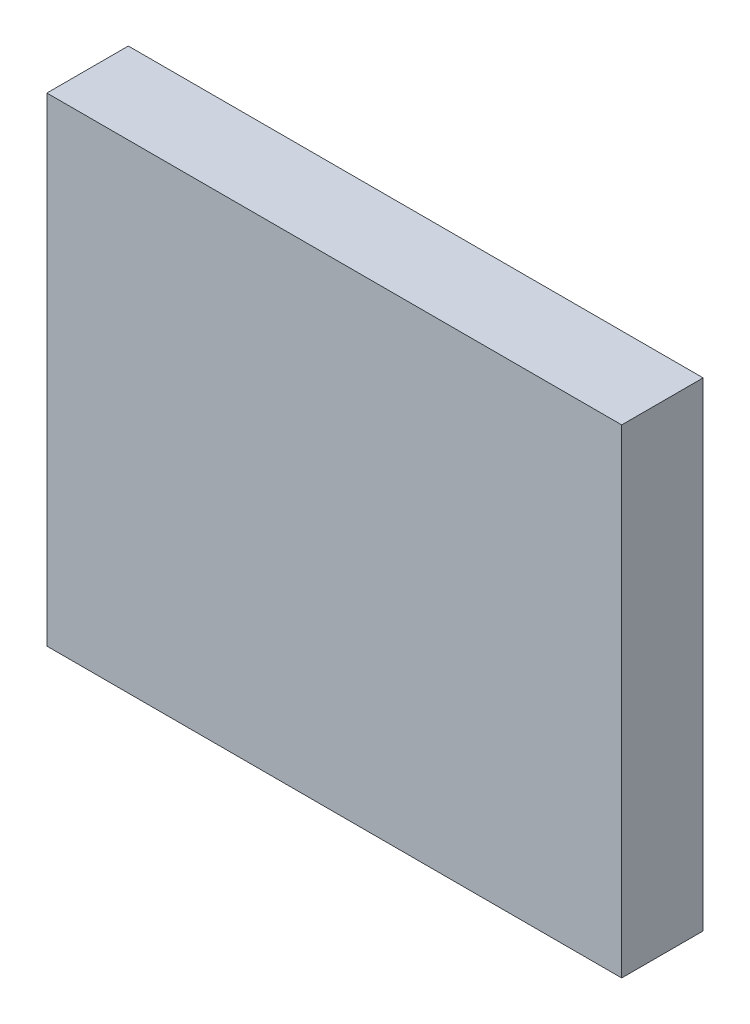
ISO-10303-21;
HEADER;
FILE_DESCRIPTION(('STEP AP214'),'2;1');
FILE_NAME('part.step','',(''),(''),'','','');
FILE_SCHEMA(('AUTOMOTIVE_DESIGN { 1 0 10303 214 1 1 1 1 }'));
ENDSEC;
DATA;
#1=APPLICATION_CONTEXT('core data for automotive mechanical design processes');
#2=APPLICATION_PROTOCOL_DEFINITION('international standard','automotive_design',2000,#1);
#3=PRODUCT_CONTEXT('',#1,'mechanical');
#4=PRODUCT('Part','Part','',(#3));
#5=PRODUCT_RELATED_PRODUCT_CATEGORY('part','',(#4));
#6=PRODUCT_DEFINITION_FORMATION('','',#4);
#7=PRODUCT_DEFINITION_CONTEXT('part definition',#1,'design');
#8=PRODUCT_DEFINITION('design','',#6,#7);
#9=PRODUCT_DEFINITION_SHAPE('','',#8);
#10=(LENGTH_UNIT() NAMED_UNIT(*) SI_UNIT(.MILLI.,.METRE.));
#11=(NAMED_UNIT(*) PLANE_ANGLE_UNIT() SI_UNIT($,.RADIAN.));
#12=(NAMED_UNIT(*) SI_UNIT($,.STERADIAN.) SOLID_ANGLE_UNIT());
#13=UNCERTAINTY_MEASURE_WITH_UNIT(LENGTH_MEASURE(1.E-05),#10,'distance_accuracy_value','');
#14=(GEOMETRIC_REPRESENTATION_CONTEXT(3) GLOBAL_UNCERTAINTY_ASSIGNED_CONTEXT((#13)) GLOBAL_UNIT_ASSIGNED_CONTEXT((#10,
#11,#12)) REPRESENTATION_CONTEXT('',''));
#15=CARTESIAN_POINT('',(0.,0.,0.));
#16=DIRECTION('',(0.,0.,1.));
#17=DIRECTION('',(1.,0.,0.));
#18=AXIS2_PLACEMENT_3D('',#15,#16,#17);
#19=CARTESIAN_POINT('',(4.4761261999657,8.20100022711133,0.00664560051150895));
#20=DIRECTION('',(0.,1.,0.));
#21=DIRECTION('',(-1.,0.,0.));
#22=AXIS2_PLACEMENT_3D('',#19,#20,#21);
#23=PLANE('',#22);
#24=DIRECTION('',(1.,0.,0.));
#25=VECTOR('',#24,1.);
#26=CARTESIAN_POINT('',(10.5,8.20100022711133,0.00664560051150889));
#27=LINE('',#26,#25);
#28=CARTESIAN_POINT('',(16.5,8.20100022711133,0.00664560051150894));
#29=VERTEX_POINT('',#28);
#30=CARTESIAN_POINT('',(4.5,8.20100022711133,0.00664560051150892));
#31=VERTEX_POINT('',#30);
#32=EDGE_CURVE('E81',#29,#31,#27,.F.);
#33=ORIENTED_EDGE('',*,*,#32,.T.);
#34=DIRECTION('',(0.,0.,1.));
#35=VECTOR('',#34,1.);
#36=CARTESIAN_POINT('',(4.5,8.20100022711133,0.00664560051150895));
#37=LINE('',#36,#35);
#38=CARTESIAN_POINT('',(4.5,8.20100022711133,0.));
#39=VERTEX_POINT('',#38);
#40=EDGE_CURVE('E67',#39,#31,#37,.T.);
#41=ORIENTED_EDGE('',*,*,#40,.F.);
#42=DIRECTION('',(1.,0.,0.));
#43=VECTOR('',#42,1.);
#44=CARTESIAN_POINT('',(16.5,8.20100022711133,0.));
#45=LINE('',#44,#43);
#46=CARTESIAN_POINT('',(16.5,8.20100022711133,0.));
#47=VERTEX_POINT('',#46);
#48=EDGE_CURVE('E90',#39,#47,#45,.T.);
#49=ORIENTED_EDGE('',*,*,#48,.T.);
#50=DIRECTION('',(0.,0.,1.));
#51=VECTOR('',#50,1.);
#52=CARTESIAN_POINT('',(16.5,8.20100022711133,0.00664560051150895));
#53=LINE('',#52,#51);
#54=EDGE_CURVE('E78',#29,#47,#53,.F.);
#55=ORIENTED_EDGE('',*,*,#54,.F.);
#56=EDGE_LOOP('',(#33,#41,#49,#55));
#57=FACE_BOUND('',#56,.T.);
#58=ADVANCED_FACE('F17',(#57),#23,.F.);
#59=CARTESIAN_POINT('',(10.5,4.50557820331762,0.0066456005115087));
#60=DIRECTION('',(0.,0.,1.));
#61=DIRECTION('',(0.,-1.,0.));
#62=AXIS2_PLACEMENT_3D('',#59,#60,#61);
#63=PLANE('',#62);
#64=DIRECTION('',(-1.,0.,0.));
#65=VECTOR('',#64,1.);
#66=CARTESIAN_POINT('',(16.5,8.2,0.0066456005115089));
#67=LINE('',#66,#65);
#68=CARTESIAN_POINT('',(16.5,8.2,0.00664560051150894));
#69=VERTEX_POINT('',#68);
#70=CARTESIAN_POINT('',(4.5,8.2,0.00664560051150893));
#71=VERTEX_POINT('',#70);
#72=EDGE_CURVE('E87',#69,#71,#67,.T.);
#73=ORIENTED_EDGE('',*,*,#72,.T.);
#74=DIRECTION('',(0.,-1.,0.));
#75=VECTOR('',#74,1.);
#76=CARTESIAN_POINT('',(4.5,8.2,0.00664560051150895));
#77=LINE('',#76,#75);
#78=EDGE_CURVE('E20',#31,#71,#77,.T.);
#79=ORIENTED_EDGE('',*,*,#78,.F.);
#80=ORIENTED_EDGE('',*,*,#32,.F.);
#81=DIRECTION('',(0.,-1.,0.));
#82=VECTOR('',#81,1.);
#83=CARTESIAN_POINT('',(16.5,8.2,0.00664560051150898));
#84=LINE('',#83,#82);
#85=EDGE_CURVE('E89',#69,#29,#84,.F.);
#86=ORIENTED_EDGE('',*,*,#85,.F.);
#87=EDGE_LOOP('',(#73,#79,#80,#86));
#88=FACE_BOUND('',#87,.T.);
#89=ADVANCED_FACE('F85',(#88),#63,.F.);
#90=CARTESIAN_POINT('',(16.5,8.2,0.));
#91=DIRECTION('',(0.,0.,1.));
#92=DIRECTION('',(1.,0.,0.));
#93=AXIS2_PLACEMENT_3D('',#90,#91,#92);
#94=PLANE('',#93);
#95=DIRECTION('',(0.,-1.,0.));
#96=VECTOR('',#95,1.);
#97=CARTESIAN_POINT('',(4.5,8.2,0.));
#98=LINE('',#97,#96);
#99=CARTESIAN_POINT('',(4.5,18.2,0.));
#100=VERTEX_POINT('',#99);
#101=EDGE_CURVE('E74',#100,#39,#98,.T.);
#102=ORIENTED_EDGE('',*,*,#101,.F.);
#103=DIRECTION('',(-1.,0.,0.));
#104=VECTOR('',#103,1.);
#105=CARTESIAN_POINT('',(16.5,18.2,0.));
#106=LINE('',#105,#104);
#107=CARTESIAN_POINT('',(16.5,18.2,0.));
#108=VERTEX_POINT('',#107);
#109=EDGE_CURVE('E130',#108,#100,#106,.T.);
#110=ORIENTED_EDGE('',*,*,#109,.F.);
#111=DIRECTION('',(0.,-1.,0.));
#112=VECTOR('',#111,1.);
#113=CARTESIAN_POINT('',(16.5,8.2,0.));
#114=LINE('',#113,#112);
#115=EDGE_CURVE('E101',#108,#47,#114,.T.);
#116=ORIENTED_EDGE('',*,*,#115,.T.);
#117=ORIENTED_EDGE('',*,*,#48,.F.);
#118=EDGE_LOOP('',(#102,#110,#116,#117));
#119=FACE_BOUND('',#118,.T.);
#120=ADVANCED_FACE('F145',(#119),#94,.F.);
#121=CARTESIAN_POINT('',(16.5,8.2,0.));
#122=DIRECTION('',(0.,1.,0.));
#123=DIRECTION('',(-1.,0.,0.));
#124=AXIS2_PLACEMENT_3D('',#121,#122,#123);
#125=PLANE('',#124);
#126=DIRECTION('',(0.,0.,1.));
#127=VECTOR('',#126,1.);
#128=CARTESIAN_POINT('',(16.5,8.2,0.));
#129=LINE('',#128,#127);
#130=CARTESIAN_POINT('',(16.5,8.2,1.7));
#131=VERTEX_POINT('',#130);
#132=EDGE_CURVE('E105',#69,#131,#129,.T.);
#133=ORIENTED_EDGE('',*,*,#132,.T.);
#134=DIRECTION('',(1.,0.,0.));
#135=VECTOR('',#134,1.);
#136=CARTESIAN_POINT('',(16.5,8.2,1.7));
#137=LINE('',#136,#135);
#138=CARTESIAN_POINT('',(4.5,8.2,1.7));
#139=VERTEX_POINT('',#138);
#140=EDGE_CURVE('E98',#139,#131,#137,.T.);
#141=ORIENTED_EDGE('',*,*,#140,.F.);
#142=DIRECTION('',(0.,0.,1.));
#143=VECTOR('',#142,1.);
#144=CARTESIAN_POINT('',(4.5,8.2,0.));
#145=LINE('',#144,#143);
#146=EDGE_CURVE('E132',#71,#139,#145,.T.);
#147=ORIENTED_EDGE('',*,*,#146,.F.);
#148=ORIENTED_EDGE('',*,*,#72,.F.);
#149=EDGE_LOOP('',(#133,#141,#147,#148));
#150=FACE_BOUND('',#149,.T.);
#151=ADVANCED_FACE('F147',(#150),#125,.F.);
#152=CARTESIAN_POINT('',(16.5,8.2,0.));
#153=DIRECTION('',(-1.,0.,0.));
#154=DIRECTION('',(0.,-1.,0.));
#155=AXIS2_PLACEMENT_3D('',#152,#153,#154);
#156=PLANE('',#155);
#157=ORIENTED_EDGE('',*,*,#115,.F.);
#158=DIRECTION('',(0.,0.,1.));
#159=VECTOR('',#158,1.);
#160=CARTESIAN_POINT('',(16.5,18.2,0.));
#161=LINE('',#160,#159);
#162=CARTESIAN_POINT('',(16.5,18.2,1.7));
#163=VERTEX_POINT('',#162);
#164=EDGE_CURVE('E104',#163,#108,#161,.F.);
#165=ORIENTED_EDGE('',*,*,#164,.F.);
#166=DIRECTION('',(0.,1.,0.));
#167=VECTOR('',#166,1.);
#168=CARTESIAN_POINT('',(16.5,8.2,1.7));
#169=LINE('',#168,#167);
#170=EDGE_CURVE('E115',#131,#163,#169,.T.);
#171=ORIENTED_EDGE('',*,*,#170,.F.);
#172=ORIENTED_EDGE('',*,*,#132,.F.);
#173=ORIENTED_EDGE('',*,*,#85,.T.);
#174=ORIENTED_EDGE('',*,*,#54,.T.);
#175=EDGE_LOOP('',(#157,#165,#171,#172,#173,#174));
#176=FACE_BOUND('',#175,.T.);
#177=ADVANCED_FACE('F143',(#176),#156,.F.);
#178=CARTESIAN_POINT('',(16.5,18.2,0.));
#179=DIRECTION('',(0.,1.,0.));
#180=DIRECTION('',(-1.,0.,0.));
#181=AXIS2_PLACEMENT_3D('',#178,#179,#180);
#182=PLANE('',#181);
#183=DIRECTION('',(0.,0.,1.));
#184=VECTOR('',#183,1.);
#185=CARTESIAN_POINT('',(4.5,18.2,0.));
#186=LINE('',#185,#184);
#187=CARTESIAN_POINT('',(4.5,18.2,1.7));
#188=VERTEX_POINT('',#187);
#189=EDGE_CURVE('E35',#188,#100,#186,.F.);
#190=ORIENTED_EDGE('',*,*,#189,.F.);
#191=DIRECTION('',(1.,0.,0.));
#192=VECTOR('',#191,1.);
#193=CARTESIAN_POINT('',(16.5,18.2,1.7));
#194=LINE('',#193,#192);
#195=EDGE_CURVE('E26',#163,#188,#194,.F.);
#196=ORIENTED_EDGE('',*,*,#195,.F.);
#197=ORIENTED_EDGE('',*,*,#164,.T.);
#198=ORIENTED_EDGE('',*,*,#109,.T.);
#199=EDGE_LOOP('',(#190,#196,#197,#198));
#200=FACE_BOUND('',#199,.T.);
#201=ADVANCED_FACE('F141',(#200),#182,.T.);
#202=CARTESIAN_POINT('',(4.5,8.2,0.));
#203=DIRECTION('',(-1.,0.,0.));
#204=DIRECTION('',(0.,-1.,0.));
#205=AXIS2_PLACEMENT_3D('',#202,#203,#204);
#206=PLANE('',#205);
#207=ORIENTED_EDGE('',*,*,#189,.T.);
#208=ORIENTED_EDGE('',*,*,#101,.T.);
#209=ORIENTED_EDGE('',*,*,#40,.T.);
#210=ORIENTED_EDGE('',*,*,#78,.T.);
#211=ORIENTED_EDGE('',*,*,#146,.T.);
#212=DIRECTION('',(0.,1.,0.));
#213=VECTOR('',#212,1.);
#214=CARTESIAN_POINT('',(4.5,8.2,1.7));
#215=LINE('',#214,#213);
#216=EDGE_CURVE('E11',#188,#139,#215,.F.);
#217=ORIENTED_EDGE('',*,*,#216,.F.);
#218=EDGE_LOOP('',(#207,#208,#209,#210,#211,#217));
#219=FACE_BOUND('',#218,.T.);
#220=ADVANCED_FACE('F69',(#219),#206,.T.);
#221=CARTESIAN_POINT('',(16.5,8.2,1.7));
#222=DIRECTION('',(0.,0.,1.));
#223=DIRECTION('',(1.,0.,0.));
#224=AXIS2_PLACEMENT_3D('',#221,#222,#223);
#225=PLANE('',#224);
#226=ORIENTED_EDGE('',*,*,#195,.T.);
#227=ORIENTED_EDGE('',*,*,#216,.T.);
#228=ORIENTED_EDGE('',*,*,#140,.T.);
#229=ORIENTED_EDGE('',*,*,#170,.T.);
#230=EDGE_LOOP('',(#226,#227,#228,#229));
#231=FACE_BOUND('',#230,.T.);
#232=ADVANCED_FACE('F139',(#231),#225,.T.);
#233=CLOSED_SHELL('',(#58,#89,#120,#151,#177,#201,#220,#232));
#234=MANIFOLD_SOLID_BREP('B1',#233);
#235=ADVANCED_BREP_SHAPE_REPRESENTATION('',(#18,#234),#14);
#236=SHAPE_DEFINITION_REPRESENTATION(#9,#235);
ENDSEC;
END-ISO-10303-21;
